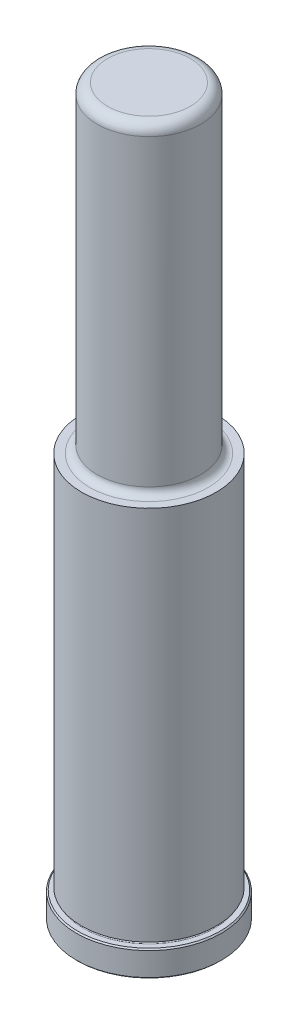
from build123d import *

# Parameters (mm, degrees)
CHAMFER1_SIZE = 0.381
FILLET7_R     = 3.175


with BuildPart() as part:
    # Sketch1 → Revolve1 (revolve)
    with BuildSketch(Plane(origin=(0, 0, 0), x_dir=(0, 0, -1), z_dir=(1, 0, 0)), mode=Mode.PRIVATE) as revolve1_sk:
        with BuildLine():
            Line((0, 0), (22.225, 0))
            Line((22.225, 0), (22.225, 7.9248))
            Line((22.225, 7.9248), (20.2438, 7.9248))
            ThreePointArc((20.2438, 7.9248), (19.8628, 8.3058), (20.2438, 8.6868))
            Line((20.2438, 8.6868), (20.6502, 8.6868))
            Line((20.6502, 8.6868), (20.6502, 123.825))
            Line((20.6502, 123.825), (18.1483, 123.825))
            ThreePointArc((18.1483, 123.825), (16.531853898, 124.494553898), (15.8623, 126.111))
            Line((15.8623, 126.111), (15.8623, 222.25))
            Line((15.8623, 222.25), (0, 222.25))
            Line((0, 222.25), (0, 0))
        make_face()
    revolve(revolve1_sk.sketch.rotate(Axis((0, 0, 0), (0, -1, 0)), 180), axis=Axis((0, 0, 0), (0, -1, 0)))

    # Chamfer1
    chamfer1_edges = [part.edges().sort_by_distance(p)[0] for p in [
        (0, 7.9248, -22.225),
        (0, 0, -22.225),
    ]]
    chamfer(chamfer1_edges, length=CHAMFER1_SIZE)

    # Fillet7
    fillet7_edges = [part.edges().sort_by_distance(p)[0] for p in [
        (0, 222.25, -15.8623),
    ]]
    fillet(fillet7_edges, radius=FILLET7_R)


solid = part.part
